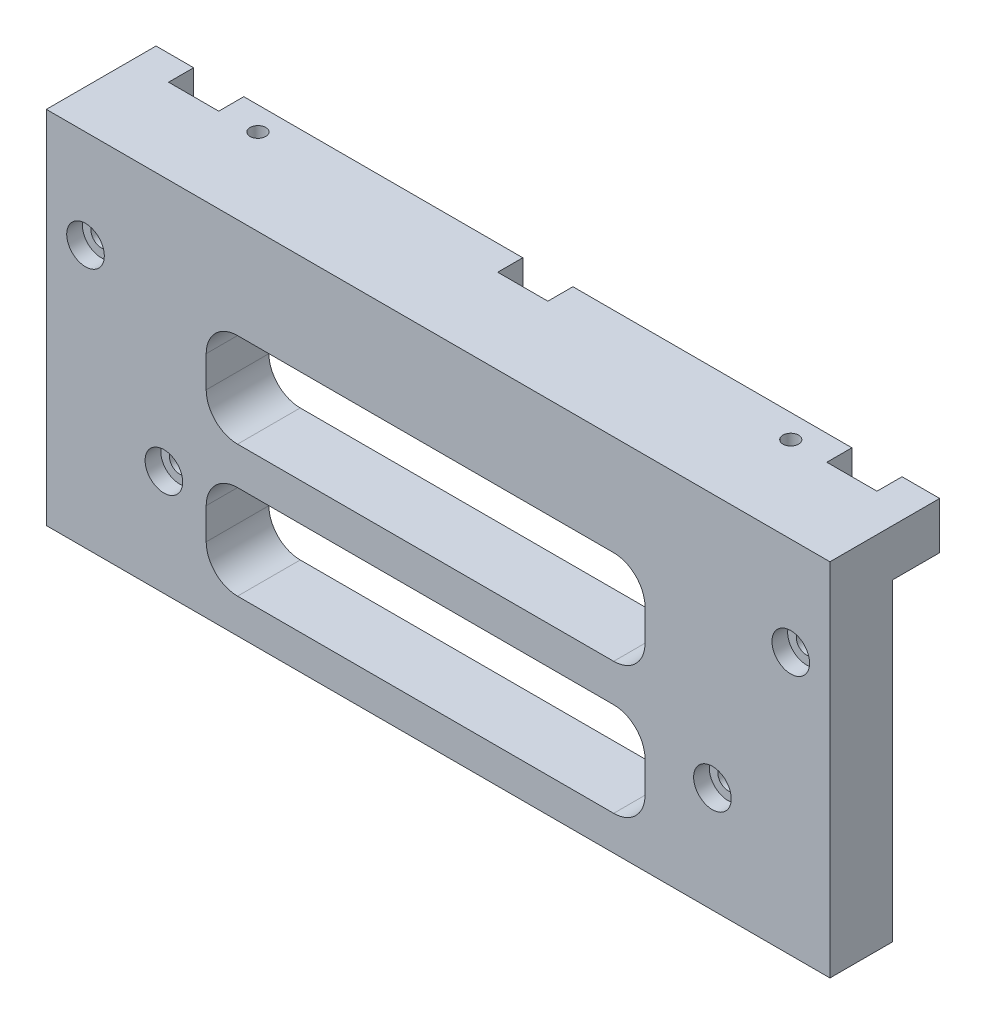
from build123d import *

# Parameters (mm, degrees)
ESQUISSE1_W             = 250
ESQUISSE1_H             = 115
BOSS_EXTRU_1_DEPTH      = 20
ESQUISSE2_W             = 140
ESQUISSE2_H             = 30
ENL_V_MAT_EXTRU_1_DEPTH = 276.907593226
ESQUISSE4_W             = 250
ESQUISSE4_H             = 15
BOSS_EXTRU_2_DEPTH      = 15
ESQUISSE7_R             = 2.5
ENL_V_MAT_EXTRU_3_DEPTH = 271
ESQUISSE8_R             = 3.25
ENL_V_MAT_EXTRU_4_DEPTH = 276.907593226
ESQUISSE9_R             = 6
ENL_V_MAT_EXTRU_5_DEPTH = 7
PIETAGE_START           = -5
ESQUISSE10_R            = 6
PIETAGE_CENTRAGE_DEPTH  = 5
CONG_1_R                = 10
ENL_V_MAT_EXTRU_6_REACH = 277.908
ESQUISSE11_W            = 16
ESQUISSE11_H            = 8


with BuildPart() as part:
    # Esquisse1 → Boss.-Extru.1 (new body)
    with BuildSketch(Plane.XY):
        with Locations((125, 57.5)):
            Rectangle(ESQUISSE1_W, ESQUISSE1_H)
    extrude(amount=BOSS_EXTRU_1_DEPTH)

    # Esquisse2 → Enl_v. mat.-Extru.1 (cut, through all)
    with BuildSketch(Plane.XY.offset(20)):
        with Locations((121, 68)):
            Rectangle(ESQUISSE2_W, ESQUISSE2_H)
        with Locations((121, 26)):
            Rectangle(ESQUISSE2_W, ESQUISSE2_H)
    extrude(amount=-ENL_V_MAT_EXTRU_1_DEPTH, mode=Mode.SUBTRACT)

    # Esquisse4 → Boss.-Extru.2 (add)
    with BuildSketch(Plane(origin=(0, 0, 0), x_dir=(-1, 0, 0), z_dir=(0, 0, -1))):
        with Locations((-125, 107.5)):
            Rectangle(ESQUISSE4_W, ESQUISSE4_H)
    extrude(amount=BOSS_EXTRU_2_DEPTH)

    # Esquisse7 → Enl_v. mat.-Extru.3 (cut, through all)
    with BuildSketch(Plane.XZ.offset(-100)):
        with Locations(Location((40, -7.5, 0), (0, 0, 270))):
            Circle(ESQUISSE7_R)
        with Locations(Location((210, -7.5, 0), (0, 0, 270))):
            Circle(ESQUISSE7_R)
    extrude(amount=-ENL_V_MAT_EXTRU_3_DEPTH, mode=Mode.SUBTRACT)

    # Esquisse8 → Enl_v. mat.-Extru.4 (cut, through all)
    with BuildSketch(Plane(origin=(0, 0, 0), x_dir=(-1, 0, 0), z_dir=(0, 0, -1))):
        with Locations((-37.5, 33.75)):
            Circle(ESQUISSE8_R)
        with Locations((-12.5, 83.75)):
            Circle(ESQUISSE8_R)
        with Locations((-212.5, 33.75)):
            Circle(ESQUISSE8_R)
        with Locations((-237.5, 83.75)):
            Circle(ESQUISSE8_R)
    extrude(amount=-ENL_V_MAT_EXTRU_4_DEPTH, mode=Mode.SUBTRACT)

    # Esquisse9 → Enl_v. mat.-Extru.5 (cut)
    with BuildSketch(Plane(origin=(0, 0, 0), x_dir=(-1, 0, 0), z_dir=(0, 0, -1))):
        with Locations((-37.5, 33.75)):
            Circle(ESQUISSE9_R)
        with Locations((-12.5, 83.75)):
            Circle(ESQUISSE9_R)
        with Locations((-212.5, 33.75)):
            Circle(ESQUISSE9_R)
        with Locations((-237.5, 83.75)):
            Circle(ESQUISSE9_R)
    extrude(amount=-ENL_V_MAT_EXTRU_5_DEPTH, mode=Mode.SUBTRACT)

    # Esquisse10 → pietage centrage (cut)
    with BuildSketch(Plane.XY.offset(20).offset(PIETAGE_START)):
        with Locations(Location((37.5, 33.75, 0), (0, 0, 180))):
            Circle(ESQUISSE10_R)
        with Locations(Location((12.5, 83.75, 0), (0, 0, 180))):
            Circle(ESQUISSE10_R)
        with Locations(Location((237.5, 83.75, 0), (0, 0, 180))):
            Circle(ESQUISSE10_R)
        with Locations(Location((212.5, 33.75, 0), (0, 0, 180))):
            Circle(ESQUISSE10_R)
    extrude(amount=PIETAGE_CENTRAGE_DEPTH, mode=Mode.SUBTRACT)

    # Cong_1
    cong_1_edges = [part.edges().sort_by_distance(p)[0] for p in [
        (51, 53, 10),
        (51, 83, 10),
        (191, 83, 10),
        (191, 53, 10),
        (51, 11, 10),
        (51, 41, 10),
        (191, 41, 10),
        (191, 11, 10),
    ]]
    fillet(cong_1_edges, radius=CONG_1_R)

    # Esquisse11 → Enl_v. mat.-Extru.6 (cut, up to next)
    with BuildSketch(Plane(origin=(0, 115, 0), x_dir=(1, 0, 0), z_dir=(0, 1, 0)), mode=Mode.PRIVATE) as enl_v_mat_extru_6_sk1:
        with Locations((20, 11)):
            Rectangle(ESQUISSE11_W, ESQUISSE11_H)
    enl_v_mat_extru_6_tool1 = extrude(enl_v_mat_extru_6_sk1.sketch, amount=-ENL_V_MAT_EXTRU_6_REACH, mode=Mode.PRIVATE) & part.part
    # Esquisse11 → Enl_v. mat.-Extru.6 (cut, up to next)
    with BuildSketch(Plane(origin=(0, 115, 0), x_dir=(1, 0, 0), z_dir=(0, 1, 0)), mode=Mode.PRIVATE) as enl_v_mat_extru_6_sk2:
        with Locations((125, 11)):
            Rectangle(ESQUISSE11_W, ESQUISSE11_H)
    enl_v_mat_extru_6_tool2 = extrude(enl_v_mat_extru_6_sk2.sketch, amount=-ENL_V_MAT_EXTRU_6_REACH, mode=Mode.PRIVATE) & part.part
    # Esquisse11 → Enl_v. mat.-Extru.6 (cut, up to next)
    with BuildSketch(Plane(origin=(0, 115, 0), x_dir=(1, 0, 0), z_dir=(0, 1, 0)), mode=Mode.PRIVATE) as enl_v_mat_extru_6_sk3:
        with Locations((230, 11)):
            Rectangle(ESQUISSE11_W, ESQUISSE11_H)
    enl_v_mat_extru_6_tool3 = extrude(enl_v_mat_extru_6_sk3.sketch, amount=-ENL_V_MAT_EXTRU_6_REACH, mode=Mode.PRIVATE) & part.part
    add(enl_v_mat_extru_6_tool1.solids().sort_by_distance((20, 115, -11))[0], mode=Mode.SUBTRACT)
    add(enl_v_mat_extru_6_tool2.solids().sort_by_distance((125, 115, -11))[0], mode=Mode.SUBTRACT)
    add(enl_v_mat_extru_6_tool3.solids().sort_by_distance((230, 115, -11))[0], mode=Mode.SUBTRACT)


solid = part.part
